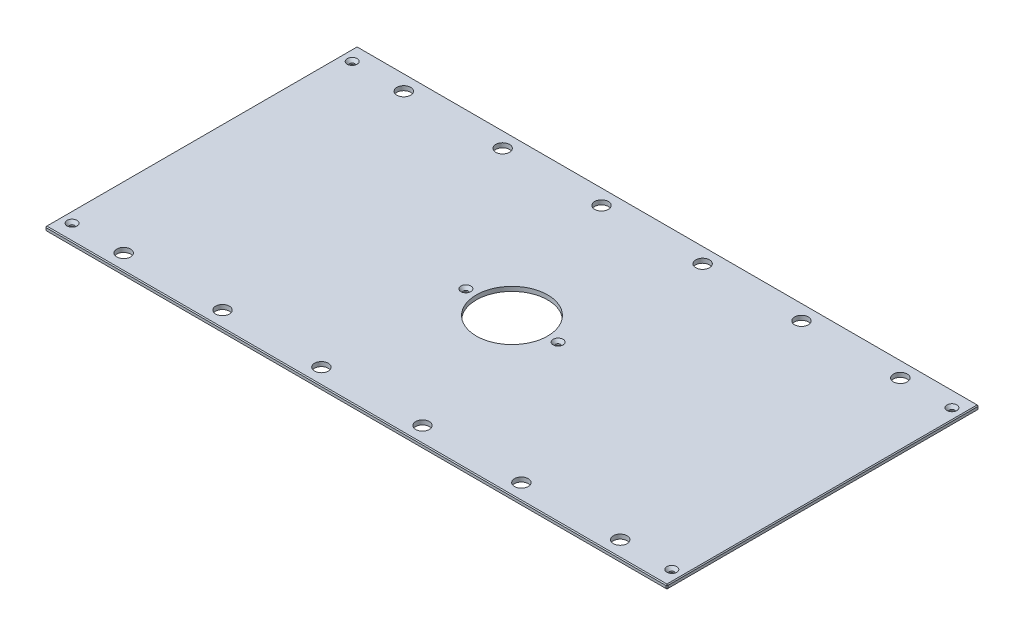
from build123d import *

# Parameters (mm, degrees)
SKETCH1_W                                     = 898.525
SKETCH1_H                                     = 450.85
BOSS_EXTRUDE1_DEPTH                           = 6.35
SKETCH13_R                                    = 51.562
CUT_EXTRUDE6_DEPTH                            = 503.686330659
F_25_32_0_78125_DIAMETER_HOLE1_D              = 19.84375
CHAMFER2_SIZE                                 = 1.27
CSK_FOR_1_4_FLAT_HEAD_MACHINE_SCREW1_AT_COUNT = 2
CSK_FOR_1_4_FLAT_HEAD_MACHINE_SCREW1_AT_PITCH = 404.80996
CSK_FOR_1_4_FLAT_HEAD_MACHINE_SCREW1_2_COUNT  = 2
CSK_FOR_1_4_FLAT_HEAD_MACHINE_SCREW1_2_PITCH  = 956.64518205
CSK_FOR_1_4_FLAT_HEAD_MACHINE_SCREW1_3_COUNT  = 2
CSK_FOR_1_4_FLAT_HEAD_MACHINE_SCREW1_3_PITCH  = 539.472223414
CSK_FOR_1_4_FLAT_HEAD_MACHINE_SCREW1_4_COUNT  = 2
CSK_FOR_1_4_FLAT_HEAD_MACHINE_SCREW1_4_PITCH  = 418.862547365
CSK_FOR_1_4_FLAT_HEAD_MACHINE_SCREW1_5_COUNT  = 2
CSK_FOR_1_4_FLAT_HEAD_MACHINE_SCREW1_5_PITCH  = 866.775
CSK_FOR_1_4_FLAT_HEAD_MACHINE_SCREW1_6_COUNT  = 2
CSK_FOR_1_4_FLAT_HEAD_MACHINE_SCREW1_6_PITCH  = 792.1625
CSK_FOR_1_4_FLAT_HEAD_MACHINE_SCREW1_7_COUNT  = 2
CSK_FOR_1_4_FLAT_HEAD_MACHINE_SCREW1_7_PITCH  = 889.602456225


with BuildPart() as part:
    # Sketch1 → Boss-Extrude1 (new body)
    with BuildSketch(Plane(origin=(0, 0, 0), x_dir=(1, 0, 0), z_dir=(0, 1, 0))):
        Rectangle(SKETCH1_W, SKETCH1_H)
    extrude(amount=BOSS_EXTRUDE1_DEPTH)

    # Sketch13 → Cut-Extrude6 (cut, through all)
    with BuildSketch(Plane(origin=(0, 6.35, 0), x_dir=(1, 0, 0), z_dir=(0, 1, 0))):
        with Locations(Location((0, 0, 0), (0, 0, 270))):
            Circle(SKETCH13_R)
    extrude(amount=-CUT_EXTRUDE6_DEPTH, mode=Mode.SUBTRACT)

    # 25_32 _0.78125_ Diameter Hole1 (through all)
    with Locations(Plane(origin=(0, 6.35, 0), x_dir=(1, 0, 0), z_dir=(0, 1, 0))):
        with Locations((358.775, 202.40498), (-358.775, 202.40498), (358.775, -202.40498), (-358.775, -202.40498), (-215.9, 202.40498), (215.9, 202.40498), (215.9, -202.40498), (-215.9, -202.40498), (73.025, 202.40498), (-73.025, 202.40498), (-73.025, -202.40498), (73.025, -202.40498)):
            Hole(F_25_32_0_78125_DIAMETER_HOLE1_D / 2)

    # Chamfer2
    chamfer2_edges = [part.edges().sort_by_distance(p)[0] for p in [
        (449.2625, 6.35, 0),
        (0, 6.35, -225.425),
        (-449.2625, 6.35, 0),
        (0, 0, -225.425),
        (449.2625, 0, 0),
        (0, 0, 225.425),
        (-449.2625, 0, 0),
        (0, 6.35, 225.425),
        (-449.2625, 3.175, -225.425),
        (449.2625, 3.175, -225.425),
        (449.2625, 3.175, 225.425),
        (-449.2625, 3.175, 225.425),
    ]]
    chamfer(chamfer2_edges, length=CHAMFER2_SIZE)

    # Sketch24 → CSK for 1_4 Flat Head Machine Screw1 (revolve, cut)
    with BuildSketch(Plane(origin=(433.3875, 6.35, -202.40498), x_dir=(0, 0, 1), z_dir=(1, 0, 0))):
        Polygon((0, 0), (0, 6.35), (3.3782, 6.35), (3.3782, 4.324464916), (7.1374, 0), align=None)
    csk_for_1_4_flat_head_machine_screw1 = revolve(axis=Axis((433.3875, 12.7, -202.40498), (0, -1, 0)), mode=Mode.SUBTRACT)

    # CSK for 1_4 Flat Head Machine Screw1 at: CSK for 1_4 Flat Head Machine Screw1 ×2
    with Locations(*[(0, 0, i * CSK_FOR_1_4_FLAT_HEAD_MACHINE_SCREW1_AT_PITCH) for i in range(1, CSK_FOR_1_4_FLAT_HEAD_MACHINE_SCREW1_AT_COUNT)]):
        add(csk_for_1_4_flat_head_machine_screw1, mode=Mode.SUBTRACT)

    # CSK for 1_4 Flat Head Machine Screw1 2: CSK for 1_4 Flat Head Machine Screw1 ×2
    with Locations(*[Vector(-0.9060569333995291, 0, 0.4231558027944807) * (i * CSK_FOR_1_4_FLAT_HEAD_MACHINE_SCREW1_2_PITCH) for i in range(1, CSK_FOR_1_4_FLAT_HEAD_MACHINE_SCREW1_2_COUNT)]):
        add(csk_for_1_4_flat_head_machine_screw1, mode=Mode.SUBTRACT)

    # CSK for 1_4 Flat Head Machine Screw1 3: CSK for 1_4 Flat Head Machine Screw1 ×2
    with Locations(*[Vector(-0.9269476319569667, 0, 0.3751907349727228) * (i * CSK_FOR_1_4_FLAT_HEAD_MACHINE_SCREW1_3_PITCH) for i in range(1, CSK_FOR_1_4_FLAT_HEAD_MACHINE_SCREW1_3_COUNT)]):
        add(csk_for_1_4_flat_head_machine_screw1, mode=Mode.SUBTRACT)

    # CSK for 1_4 Flat Head Machine Screw1 4: CSK for 1_4 Flat Head Machine Screw1 ×2
    with Locations(*[Vector(-0.8754960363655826, 0, 0.48322529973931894) * (i * CSK_FOR_1_4_FLAT_HEAD_MACHINE_SCREW1_4_PITCH) for i in range(1, CSK_FOR_1_4_FLAT_HEAD_MACHINE_SCREW1_4_COUNT)]):
        add(csk_for_1_4_flat_head_machine_screw1, mode=Mode.SUBTRACT)

    # CSK for 1_4 Flat Head Machine Screw1 5: CSK for 1_4 Flat Head Machine Screw1 ×2
    with Locations(*[(-i * CSK_FOR_1_4_FLAT_HEAD_MACHINE_SCREW1_5_PITCH, 0, 0) for i in range(1, CSK_FOR_1_4_FLAT_HEAD_MACHINE_SCREW1_5_COUNT)]):
        add(csk_for_1_4_flat_head_machine_screw1, mode=Mode.SUBTRACT)

    # CSK for 1_4 Flat Head Machine Screw1 6: CSK for 1_4 Flat Head Machine Screw1 ×2
    with Locations(*[(-i * CSK_FOR_1_4_FLAT_HEAD_MACHINE_SCREW1_6_PITCH, 0, 0) for i in range(1, CSK_FOR_1_4_FLAT_HEAD_MACHINE_SCREW1_6_COUNT)]):
        add(csk_for_1_4_flat_head_machine_screw1, mode=Mode.SUBTRACT)

    # CSK for 1_4 Flat Head Machine Screw1 7: CSK for 1_4 Flat Head Machine Screw1 ×2
    with Locations(*[Vector(-0.8904679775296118, 0, 0.4550459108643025) * (i * CSK_FOR_1_4_FLAT_HEAD_MACHINE_SCREW1_7_PITCH) for i in range(1, CSK_FOR_1_4_FLAT_HEAD_MACHINE_SCREW1_7_COUNT)]):
        add(csk_for_1_4_flat_head_machine_screw1, mode=Mode.SUBTRACT)


solid = part.part
